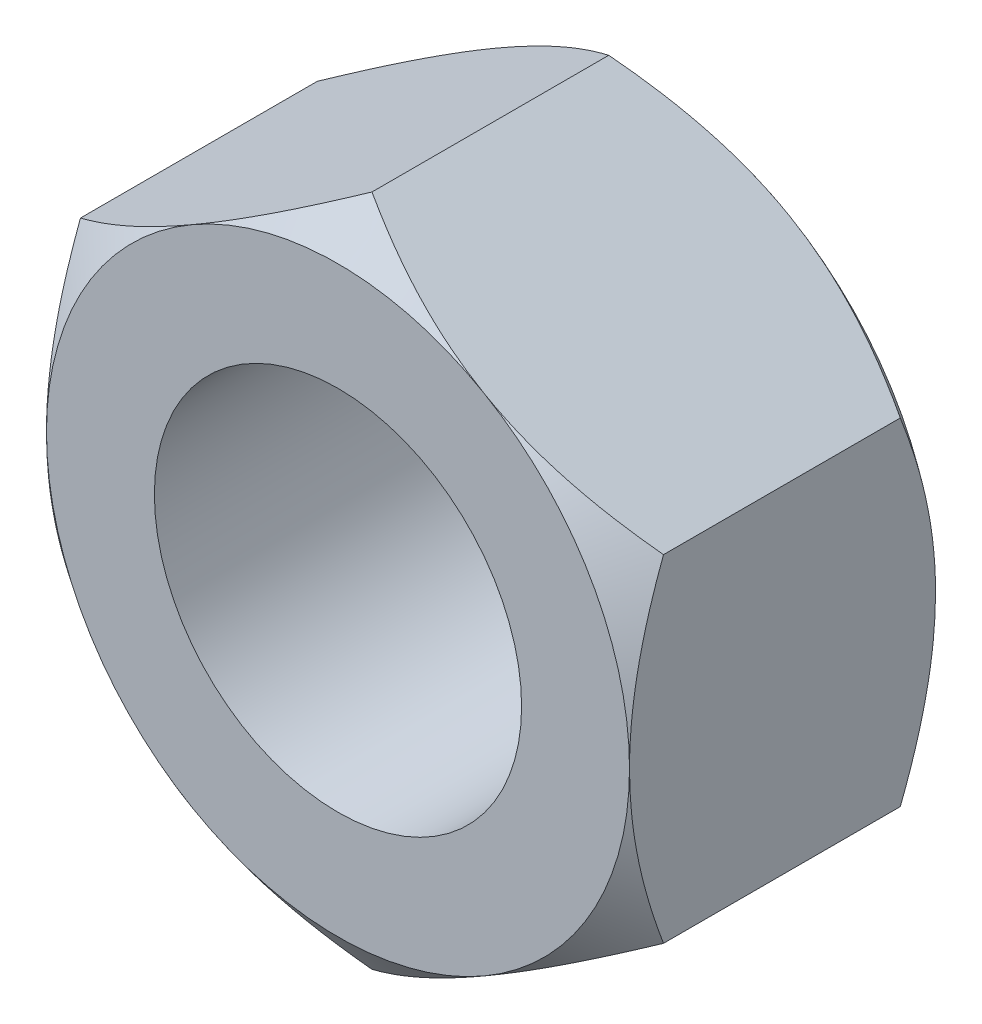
ISO-10303-21;
HEADER;
FILE_DESCRIPTION(('STEP AP214'),'2;1');
FILE_NAME('part.step','',(''),(''),'','','');
FILE_SCHEMA(('AUTOMOTIVE_DESIGN { 1 0 10303 214 1 1 1 1 }'));
ENDSEC;
DATA;
#1=APPLICATION_CONTEXT('core data for automotive mechanical design processes');
#2=APPLICATION_PROTOCOL_DEFINITION('international standard','automotive_design',2000,#1);
#3=PRODUCT_CONTEXT('',#1,'mechanical');
#4=PRODUCT('Part','Part','',(#3));
#5=PRODUCT_RELATED_PRODUCT_CATEGORY('part','',(#4));
#6=PRODUCT_DEFINITION_FORMATION('','',#4);
#7=PRODUCT_DEFINITION_CONTEXT('part definition',#1,'design');
#8=PRODUCT_DEFINITION('design','',#6,#7);
#9=PRODUCT_DEFINITION_SHAPE('','',#8);
#10=(LENGTH_UNIT() NAMED_UNIT(*) SI_UNIT(.MILLI.,.METRE.));
#11=(NAMED_UNIT(*) PLANE_ANGLE_UNIT() SI_UNIT($,.RADIAN.));
#12=(NAMED_UNIT(*) SI_UNIT($,.STERADIAN.) SOLID_ANGLE_UNIT());
#13=UNCERTAINTY_MEASURE_WITH_UNIT(LENGTH_MEASURE(1.E-05),#10,'distance_accuracy_value','');
#14=(GEOMETRIC_REPRESENTATION_CONTEXT(3) GLOBAL_UNCERTAINTY_ASSIGNED_CONTEXT((#13)) GLOBAL_UNIT_ASSIGNED_CONTEXT((#10,
#11,#12)) REPRESENTATION_CONTEXT('',''));
#15=CARTESIAN_POINT('',(0.,0.,0.));
#16=DIRECTION('',(0.,0.,1.));
#17=DIRECTION('',(1.,0.,0.));
#18=AXIS2_PLACEMENT_3D('',#15,#16,#17);
#19=CARTESIAN_POINT('',(-4.76313972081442,2.75,-5.));
#20=DIRECTION('',(-1.,0.,0.));
#21=DIRECTION('',(0.,-1.,0.));
#22=AXIS2_PLACEMENT_3D('',#19,#20,#21);
#23=PLANE('',#22);
#24=DIRECTION('',(0.,0.,1.));
#25=VECTOR('',#24,1.);
#26=CARTESIAN_POINT('',(-4.76313972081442,2.75,-5.));
#27=LINE('',#26,#25);
#28=CARTESIAN_POINT('',(-4.76313972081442,2.75,-4.42430165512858));
#29=VERTEX_POINT('',#28);
#30=CARTESIAN_POINT('',(-4.76313972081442,2.75,-0.555264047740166));
#31=VERTEX_POINT('',#30);
#32=EDGE_CURVE('E257',#29,#31,#27,.T.);
#33=ORIENTED_EDGE('',*,*,#32,.F.);
#34=CARTESIAN_POINT('',(-4.7631397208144,-6.40995958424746,-2.48208008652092));
#35=CARTESIAN_POINT('',(-4.7631397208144,-6.24286028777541,-2.58684300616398));
#36=CARTESIAN_POINT('',(-4.7631397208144,-6.07511976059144,-2.69060000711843));
#37=CARTESIAN_POINT('',(-4.7631397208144,-5.73806517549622,-2.89560261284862));
#38=CARTESIAN_POINT('',(-4.7631397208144,-5.56875079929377,-2.99684769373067));
#39=CARTESIAN_POINT('',(-4.7631397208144,-5.22718056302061,-3.19695438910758));
#40=CARTESIAN_POINT('',(-4.7631397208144,-5.05491257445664,-3.29579537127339));
#41=CARTESIAN_POINT('',(-4.7631397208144,-4.70824421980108,-3.48965168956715));
#42=CARTESIAN_POINT('',(-4.7631397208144,-4.53384398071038,-3.58466725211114));
#43=CARTESIAN_POINT('',(-4.7631397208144,-4.17394695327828,-3.77448040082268));
#44=CARTESIAN_POINT('',(-4.7631397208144,-3.9883242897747,-3.86904057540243));
#45=CARTESIAN_POINT('',(-4.7631397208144,-3.61380613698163,-4.05155429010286));
#46=CARTESIAN_POINT('',(-4.7631397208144,-3.42491020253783,-4.13950692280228));
#47=CARTESIAN_POINT('',(-4.7631397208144,-3.04385740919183,-4.30674347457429));
#48=CARTESIAN_POINT('',(-4.7631397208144,-2.85171004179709,-4.38604882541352));
#49=CARTESIAN_POINT('',(-4.7631397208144,-2.4633488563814,-4.53388173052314));
#50=CARTESIAN_POINT('',(-4.7631397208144,-2.26713663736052,-4.60241343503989));
#51=CARTESIAN_POINT('',(-4.76313972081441,-1.86832727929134,-4.72653632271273));
#52=CARTESIAN_POINT('',(-4.76313972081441,-1.66568471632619,-4.78198398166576));
#53=CARTESIAN_POINT('',(-4.76313972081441,-1.25641216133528,-4.87574292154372));
#54=CARTESIAN_POINT('',(-4.76313972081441,-1.04978264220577,-4.91405622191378));
#55=CARTESIAN_POINT('',(-4.76313972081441,-0.637390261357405,-4.97011747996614));
#56=CARTESIAN_POINT('',(-4.76313972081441,-0.431676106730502,-4.98821538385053));
#57=CARTESIAN_POINT('',(-4.76313972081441,-0.019459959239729,-5.00344342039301));
#58=CARTESIAN_POINT('',(-4.76313972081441,0.187041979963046,-5.00057495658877));
#59=CARTESIAN_POINT('',(-4.76313972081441,0.582480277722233,-4.97519185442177));
#60=CARTESIAN_POINT('',(-4.76313972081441,0.771521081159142,-4.95423973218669));
#61=CARTESIAN_POINT('',(-4.76313972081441,1.14709578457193,-4.89631076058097));
#62=CARTESIAN_POINT('',(-4.76313972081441,1.33362949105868,-4.85933268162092));
#63=CARTESIAN_POINT('',(-4.76313972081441,1.70702035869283,-4.77073057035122));
#64=CARTESIAN_POINT('',(-4.76313972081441,1.89381165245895,-4.71883264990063));
#65=CARTESIAN_POINT('',(-4.76313972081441,2.17116202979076,-4.6321604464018));
#66=CARTESIAN_POINT('',(-4.76313972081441,2.26313790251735,-4.60179939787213));
#67=CARTESIAN_POINT('',(-4.76313972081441,2.44617130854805,-4.53842694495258));
#68=CARTESIAN_POINT('',(-4.76313972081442,2.53722886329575,-4.50541560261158));
#69=CARTESIAN_POINT('',(-4.76313972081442,2.79225842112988,-4.40916695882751));
#70=CARTESIAN_POINT('',(-4.76313972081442,2.9552064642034,-4.34321200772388));
#71=CARTESIAN_POINT('',(-4.76313972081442,3.27840071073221,-4.20495204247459));
#72=CARTESIAN_POINT('',(-4.76313972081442,3.43864631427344,-4.13264563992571));
#73=CARTESIAN_POINT('',(-4.76313972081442,3.7568341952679,-3.98281412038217));
#74=CARTESIAN_POINT('',(-4.76313972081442,3.91477440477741,-3.90528463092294));
#75=CARTESIAN_POINT('',(-4.76313972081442,4.2284966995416,-3.74602002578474));
#76=CARTESIAN_POINT('',(-4.76313972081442,4.38427893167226,-3.6642851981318));
#77=CARTESIAN_POINT('',(-4.76313972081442,4.69467491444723,-3.49698449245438));
#78=CARTESIAN_POINT('',(-4.76313972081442,4.84928021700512,-3.41140298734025));
#79=CARTESIAN_POINT('',(-4.76313972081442,5.15686083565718,-3.23735439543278));
#80=CARTESIAN_POINT('',(-4.76313972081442,5.30983608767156,-3.14888719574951));
#81=CARTESIAN_POINT('',(-4.76313972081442,5.76650948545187,-2.87999272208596));
#82=CARTESIAN_POINT('',(-4.76313972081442,6.06810328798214,-2.69599155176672));
#83=CARTESIAN_POINT('',(-4.76313972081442,6.63875962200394,-2.33896262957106));
#84=CARTESIAN_POINT('',(-4.76313972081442,6.90820406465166,-2.16654007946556));
#85=CARTESIAN_POINT('',(-4.76313972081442,7.44440299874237,-1.81750104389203));
#86=CARTESIAN_POINT('',(-4.76313972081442,7.71115717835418,-1.64088408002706));
#87=CARTESIAN_POINT('',(-4.76313972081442,8.23987356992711,-1.28622636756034));
#88=CARTESIAN_POINT('',(-4.76313972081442,8.50185705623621,-1.10821723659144));
#89=CARTESIAN_POINT('',(-4.76313972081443,9.02405717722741,-0.749736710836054));
#90=CARTESIAN_POINT('',(-4.76313972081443,9.28427415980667,-0.569265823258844));
#91=CARTESIAN_POINT('',(-4.76313972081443,9.54383141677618,-0.387862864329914));
#92=B_SPLINE_CURVE_WITH_KNOTS('',3,(#34,#35,#36,#37,#38,#39,#40,#41,#42,#43,#44,#45,#46,#47,#48,
#49,#50,#51,#52,#53,#54,#55,#56,#57,#58,#59,#60,#61,#62,#63,#64,#65,#66,#67,#68,#69,#70,#71,#72,
#73,#74,#75,#76,#77,#78,#79,#80,#81,#82,#83,#84,#85,#86,#87,#88,#89,#90,#91),.UNSPECIFIED.,.F.,
.F.,(4,2,2,2,2,2,2,2,2,2,2,2,2,2,2,2,2,2,2,2,2,2,2,2,2,2,2,2,4),(0.,0.591682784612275,
1.18348795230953,1.77927690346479,2.37503053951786,2.99988835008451,3.62483181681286,
4.24818939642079,4.87130625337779,5.50096987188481,6.13055925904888,6.74907232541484,
7.36754398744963,7.93738514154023,8.50727002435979,9.08836926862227,9.37890931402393,
9.66944255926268,10.1966315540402,10.7239360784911,11.2516876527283,11.7794031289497,
12.3095005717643,12.8396187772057,13.8993492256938,14.8589790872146,15.8187189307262,
16.7689160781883,17.7189203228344),.UNSPECIFIED.);
#93=CARTESIAN_POINT('',(-4.76313972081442,0.,-5.));
#94=VERTEX_POINT('',#93);
#95=EDGE_CURVE('E148',#29,#94,#92,.F.);
#96=ORIENTED_EDGE('',*,*,#95,.T.);
#97=CARTESIAN_POINT('',(-4.7631397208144,-2.75000000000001,-4.42430165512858));
#98=VERTEX_POINT('',#97);
#99=EDGE_CURVE('E157',#94,#98,#92,.F.);
#100=ORIENTED_EDGE('',*,*,#99,.T.);
#101=DIRECTION('',(0.,0.,1.));
#102=VECTOR('',#101,1.);
#103=CARTESIAN_POINT('',(-4.7631397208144,-2.75000000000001,-5.));
#104=LINE('',#103,#102);
#105=CARTESIAN_POINT('',(-4.7631397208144,-2.75000000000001,-0.555264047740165));
#106=VERTEX_POINT('',#105);
#107=EDGE_CURVE('E264',#98,#106,#104,.T.);
#108=ORIENTED_EDGE('',*,*,#107,.T.);
#109=CARTESIAN_POINT('',(-4.7631397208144,-6.52667787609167,-2.49936933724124));
#110=CARTESIAN_POINT('',(-4.7631397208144,-6.35458657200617,-2.39464437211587));
#111=CARTESIAN_POINT('',(-4.7631397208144,-6.18187076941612,-2.29092857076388));
#112=CARTESIAN_POINT('',(-4.7631397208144,-5.83490079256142,-2.08602472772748));
#113=CARTESIAN_POINT('',(-4.7631397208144,-5.66064631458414,-1.98483720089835));
#114=CARTESIAN_POINT('',(-4.7631397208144,-5.30922187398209,-1.78488373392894));
#115=CARTESIAN_POINT('',(-4.7631397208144,-5.132040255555,-1.68613820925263));
#116=CARTESIAN_POINT('',(-4.7631397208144,-4.77558445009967,-1.49251204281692));
#117=CARTESIAN_POINT('',(-4.7631397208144,-4.59631038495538,-1.39763117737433));
#118=CARTESIAN_POINT('',(-4.7631397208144,-4.22688221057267,-1.20836695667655));
#119=CARTESIAN_POINT('',(-4.7631397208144,-4.03661020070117,-1.11421251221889));
#120=CARTESIAN_POINT('',(-4.7631397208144,-3.652854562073,-0.932577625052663));
#121=CARTESIAN_POINT('',(-4.7631397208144,-3.45937050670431,-0.845098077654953));
#122=CARTESIAN_POINT('',(-4.7631397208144,-3.06920692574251,-0.678900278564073));
#123=CARTESIAN_POINT('',(-4.7631397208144,-2.87253648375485,-0.600160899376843));
#124=CARTESIAN_POINT('',(-4.7631397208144,-2.47520474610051,-0.453599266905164));
#125=CARTESIAN_POINT('',(-4.7631397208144,-2.27454498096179,-0.385772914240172));
#126=CARTESIAN_POINT('',(-4.76313972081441,-1.8640140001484,-0.262386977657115));
#127=CARTESIAN_POINT('',(-4.76313972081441,-1.65403764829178,-0.207170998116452));
#128=CARTESIAN_POINT('',(-4.76313972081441,-1.23012378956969,-0.1146198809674));
#129=CARTESIAN_POINT('',(-4.76313972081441,-1.01618688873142,-0.0772820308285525));
#130=CARTESIAN_POINT('',(-4.76313972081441,-0.589334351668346,-0.023954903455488));
#131=CARTESIAN_POINT('',(-4.76313972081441,-0.376464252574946,-0.00761007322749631));
#132=CARTESIAN_POINT('',(-4.76313972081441,0.0498511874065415,0.0033921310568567));
#133=CARTESIAN_POINT('',(-4.76313972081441,0.26329651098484,-0.00194984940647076));
#134=CARTESIAN_POINT('',(-4.76313972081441,0.671122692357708,-0.0324900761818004));
#135=CARTESIAN_POINT('',(-4.76313972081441,0.865633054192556,-0.0560260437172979));
#136=CARTESIAN_POINT('',(-4.76313972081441,1.2519812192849,-0.119195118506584));
#137=CARTESIAN_POINT('',(-4.76313972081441,1.44381885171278,-0.158829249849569));
#138=CARTESIAN_POINT('',(-4.76313972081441,1.82782928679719,-0.252718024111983));
#139=CARTESIAN_POINT('',(-4.76313972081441,2.01993473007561,-0.3072444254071));
#140=CARTESIAN_POINT('',(-4.76313972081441,2.30525521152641,-0.397741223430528));
#141=CARTESIAN_POINT('',(-4.76313972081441,2.39988760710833,-0.429357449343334));
#142=CARTESIAN_POINT('',(-4.76313972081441,2.58823901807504,-0.495196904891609));
#143=CARTESIAN_POINT('',(-4.76313972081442,2.68195806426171,-0.529420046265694));
#144=CARTESIAN_POINT('',(-4.76313972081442,2.95885962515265,-0.634462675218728));
#145=CARTESIAN_POINT('',(-4.76313972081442,3.14077712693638,-0.708623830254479));
#146=CARTESIAN_POINT('',(-4.76313972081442,3.5015403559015,-0.864112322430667));
#147=CARTESIAN_POINT('',(-4.76313972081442,3.68038532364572,-0.945441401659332));
#148=CARTESIAN_POINT('',(-4.76313972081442,4.03552247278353,-1.11387738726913));
#149=CARTESIAN_POINT('',(-4.76313972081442,4.21181215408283,-1.20098954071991));
#150=CARTESIAN_POINT('',(-4.76313972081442,4.56203233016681,-1.37977912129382));
#151=CARTESIAN_POINT('',(-4.76313972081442,4.73596300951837,-1.47145618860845));
#152=CARTESIAN_POINT('',(-4.76313972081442,5.0826144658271,-1.6589290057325));
#153=CARTESIAN_POINT('',(-4.76313972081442,5.2553260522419,-1.75474169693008));
#154=CARTESIAN_POINT('',(-4.76313972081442,5.59903046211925,-1.94940702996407));
#155=CARTESIAN_POINT('',(-4.76313972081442,5.77002322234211,-2.0482597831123));
#156=CARTESIAN_POINT('',(-4.76313972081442,6.28063794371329,-2.3484332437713));
#157=CARTESIAN_POINT('',(-4.76313972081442,6.6180759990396,-2.5534678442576));
#158=CARTESIAN_POINT('',(-4.76313972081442,7.25445162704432,-2.94910954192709));
#159=CARTESIAN_POINT('',(-4.76313972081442,7.55380453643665,-3.13905415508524));
#160=CARTESIAN_POINT('',(-4.76313972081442,8.14988607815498,-3.52309555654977));
#161=CARTESIAN_POINT('',(-4.76313972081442,8.44661437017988,-3.71719287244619));
#162=CARTESIAN_POINT('',(-4.76313972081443,9.03509530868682,-4.10659479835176));
#163=CARTESIAN_POINT('',(-4.76313972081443,9.32686821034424,-4.30186888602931));
#164=CARTESIAN_POINT('',(-4.76313972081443,9.90871786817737,-4.69480502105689));
#165=CARTESIAN_POINT('',(-4.76313972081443,10.1987949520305,-4.89246658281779));
#166=CARTESIAN_POINT('',(-4.76313972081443,10.4882515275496,-5.09102228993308));
#167=B_SPLINE_CURVE_WITH_KNOTS('',3,(#109,#110,#111,#112,#113,#114,#115,#116,#117,#118,#119,
#120,#121,#122,#123,#124,#125,#126,#127,#128,#129,#130,#131,#132,#133,#134,#135,#136,#137,#138,
#139,#140,#141,#142,#143,#144,#145,#146,#147,#148,#149,#150,#151,#152,#153,#154,#155,#156,#157,
#158,#159,#160,#161,#162,#163,#164,#165,#166),.UNSPECIFIED.,.F.,.F.,(4,2,2,2,2,2,2,2,2,2,2,2,2,
2,2,2,2,2,2,2,2,2,2,2,2,2,2,2,4),(0.,0.604364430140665,1.20885094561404,1.81733113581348,
2.4257760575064,3.06255413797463,3.69941748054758,4.33470618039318,4.96975567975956,
5.62045978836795,6.27106513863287,6.91049941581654,7.54991466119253,8.13695505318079,
8.72403279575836,9.3226362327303,9.62192841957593,9.92121047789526,10.5103558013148,
11.0996447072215,11.6894757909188,12.2792604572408,12.8717464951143,13.4642542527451,
14.6486551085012,15.7122077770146,16.7758963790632,17.8291502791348,18.882193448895),.UNSPECIFIED.);
#168=CARTESIAN_POINT('',(-4.76313972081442,0.,0.));
#169=VERTEX_POINT('',#168);
#170=EDGE_CURVE('E310',#106,#169,#167,.T.);
#171=ORIENTED_EDGE('',*,*,#170,.T.);
#172=EDGE_CURVE('E307',#169,#31,#167,.T.);
#173=ORIENTED_EDGE('',*,*,#172,.T.);
#174=EDGE_LOOP('',(#33,#96,#100,#108,#171,#173));
#175=FACE_BOUND('',#174,.T.);
#176=ADVANCED_FACE('F28',(#175),#23,.T.);
#177=CARTESIAN_POINT('',(0.,5.50000000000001,-5.));
#178=DIRECTION('',(-0.500000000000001,0.866025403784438,0.));
#179=DIRECTION('',(-0.866025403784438,-0.500000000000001,0.));
#180=AXIS2_PLACEMENT_3D('',#177,#178,#179);
#181=PLANE('',#180);
#182=DIRECTION('',(0.,0.,1.));
#183=VECTOR('',#182,1.);
#184=CARTESIAN_POINT('',(0.,5.50000000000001,-5.));
#185=LINE('',#184,#183);
#186=CARTESIAN_POINT('',(0.,5.50000000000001,-4.42430165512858));
#187=VERTEX_POINT('',#186);
#188=CARTESIAN_POINT('',(0.,5.50000000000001,-0.555264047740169));
#189=VERTEX_POINT('',#188);
#190=EDGE_CURVE('E255',#187,#189,#185,.T.);
#191=ORIENTED_EDGE('',*,*,#190,.F.);
#192=CARTESIAN_POINT('',(0.000199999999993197,5.50011547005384,-4.42421143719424));
#193=CARTESIAN_POINT('',(-0.169583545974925,5.40209089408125,-4.50076965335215));
#194=CARTESIAN_POINT('',(-0.341323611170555,5.30293672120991,-4.57213656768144));
#195=CARTESIAN_POINT('',(-0.689104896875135,5.10214510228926,-4.70150205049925));
#196=CARTESIAN_POINT('',(-0.865157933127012,5.00050083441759,-4.75945792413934));
#197=CARTESIAN_POINT('',(-1.21919836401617,4.79609549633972,-4.85802484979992));
#198=CARTESIAN_POINT('',(-1.39715159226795,4.69335415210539,-4.89879514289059));
#199=CARTESIAN_POINT('',(-1.75543237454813,4.48650064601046,-4.9607079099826));
#200=CARTESIAN_POINT('',(-1.93575670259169,4.38239034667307,-4.98187471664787));
#201=CARTESIAN_POINT('',(-2.3000854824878,4.17204502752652,-5.00293890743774));
#202=CARTESIAN_POINT('',(-2.48410449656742,4.06580160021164,-5.00251164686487));
#203=CARTESIAN_POINT('',(-2.85117873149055,3.85387119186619,-4.97961179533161));
#204=CARTESIAN_POINT('',(-3.03423338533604,3.74818453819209,-4.9571274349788));
#205=CARTESIAN_POINT('',(-3.39757970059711,3.53840644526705,-4.89215538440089));
#206=CARTESIAN_POINT('',(-3.57787145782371,3.4343149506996,-4.84966838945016));
#207=CARTESIAN_POINT('',(-3.93475619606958,3.22826745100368,-4.74788059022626));
#208=CARTESIAN_POINT('',(-4.11134994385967,3.12631100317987,-4.68858330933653));
#209=CARTESIAN_POINT('',(-4.3664538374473,2.97902670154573,-4.59211737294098));
#210=CARTESIAN_POINT('',(-4.44651372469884,2.93280410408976,-4.56025443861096));
#211=CARTESIAN_POINT('',(-4.60562184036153,2.84094299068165,-4.49404002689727));
#212=CARTESIAN_POINT('',(-4.68467217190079,2.79530326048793,-4.459695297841));
#213=CARTESIAN_POINT('',(-4.76333972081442,2.74988452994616,-4.42421143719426));
#214=B_SPLINE_CURVE_WITH_KNOTS('',3,(#192,#193,#194,#195,#196,#197,#198,#199,#200,#201,#202,
#203,#204,#205,#206,#207,#208,#209,#210,#211,#212,#213),.UNSPECIFIED.,.F.,.F.,(4,2,2,2,2,2,2,2,
2,2,4),(0.,0.631654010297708,1.26529208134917,1.89292245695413,2.51977274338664,
3.15604984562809,3.79266664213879,4.42926131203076,5.06572265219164,5.35904081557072,
5.65158942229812),.UNSPECIFIED.);
#215=CARTESIAN_POINT('',(-2.38156986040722,4.125,-5.));
#216=VERTEX_POINT('',#215);
#217=EDGE_CURVE('E127',#187,#216,#214,.T.);
#218=ORIENTED_EDGE('',*,*,#217,.T.);
#219=EDGE_CURVE('E51',#216,#29,#214,.T.);
#220=ORIENTED_EDGE('',*,*,#219,.T.);
#221=ORIENTED_EDGE('',*,*,#32,.T.);
#222=CARTESIAN_POINT('',(-4.76333972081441,2.74988452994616,-0.55535106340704));
#223=CARTESIAN_POINT('',(-4.58839620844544,2.85088821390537,-0.479261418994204));
#224=CARTESIAN_POINT('',(-4.41149117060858,2.95302438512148,-0.408548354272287));
#225=CARTESIAN_POINT('',(-4.05340869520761,3.15976339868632,-0.280967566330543));
#226=CARTESIAN_POINT('',(-3.8722197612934,3.26437287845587,-0.224143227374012));
#227=CARTESIAN_POINT('',(-3.50806497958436,3.47461773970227,-0.128405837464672));
#228=CARTESIAN_POINT('',(-3.32513307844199,3.58023352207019,-0.0893254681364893));
#229=CARTESIAN_POINT('',(-2.95706281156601,3.79273898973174,-0.0313481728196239));
#230=CARTESIAN_POINT('',(-2.77192749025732,3.89962691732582,-0.0124260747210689));
#231=CARTESIAN_POINT('',(-2.39832843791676,4.11532443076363,0.00369118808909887));
#232=CARTESIAN_POINT('',(-2.20985438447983,4.2241399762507,0.00057860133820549));
#233=CARTESIAN_POINT('',(-1.83408971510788,4.44108780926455,-0.0278038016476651));
#234=CARTESIAN_POINT('',(-1.64679984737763,4.5492196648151,-0.0530864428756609));
#235=CARTESIAN_POINT('',(-1.27516310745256,4.76378423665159,-0.12350980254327));
#236=CARTESIAN_POINT('',(-1.09081558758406,4.87021732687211,-0.168646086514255));
#237=CARTESIAN_POINT('',(-0.725856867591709,5.0809263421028,-0.275446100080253));
#238=CARTESIAN_POINT('',(-0.545244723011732,5.18520281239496,-0.337105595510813));
#239=CARTESIAN_POINT('',(-0.304935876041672,5.32394518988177,-0.428883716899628));
#240=CARTESIAN_POINT('',(-0.243525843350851,5.35940028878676,-0.45320850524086));
#241=CARTESIAN_POINT('',(-0.121273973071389,5.42998243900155,-0.503254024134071));
#242=CARTESIAN_POINT('',(-0.0604312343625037,5.46511001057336,-0.528971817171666));
#243=CARTESIAN_POINT('',(0.000199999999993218,5.50011547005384,-0.555351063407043));
#244=B_SPLINE_CURVE_WITH_KNOTS('',3,(#222,#223,#224,#225,#226,#227,#228,#229,#230,#231,#232,
#233,#234,#235,#236,#237,#238,#239,#240,#241,#242,#243),.UNSPECIFIED.,.F.,.F.,(4,2,2,2,2,2,2,2,
2,2,4),(0.,0.647850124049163,1.2976987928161,1.94128546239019,2.58406752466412,3.23584465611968,
3.88799907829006,4.54000791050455,5.19184982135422,5.41674001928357,5.6411731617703),.UNSPECIFIED.);
#245=CARTESIAN_POINT('',(-2.38156986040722,4.125,0.));
#246=VERTEX_POINT('',#245);
#247=EDGE_CURVE('E302',#31,#246,#244,.T.);
#248=ORIENTED_EDGE('',*,*,#247,.T.);
#249=EDGE_CURVE('E228',#246,#189,#244,.T.);
#250=ORIENTED_EDGE('',*,*,#249,.T.);
#251=EDGE_LOOP('',(#191,#218,#220,#221,#248,#250));
#252=FACE_BOUND('',#251,.T.);
#253=ADVANCED_FACE('F236',(#252),#181,.T.);
#254=CARTESIAN_POINT('',(4.76313972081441,2.75000000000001,-5.));
#255=DIRECTION('',(0.499999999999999,0.866025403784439,0.));
#256=DIRECTION('',(-0.866025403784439,0.499999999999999,0.));
#257=AXIS2_PLACEMENT_3D('',#254,#255,#256);
#258=PLANE('',#257);
#259=DIRECTION('',(0.,0.,1.));
#260=VECTOR('',#259,1.);
#261=CARTESIAN_POINT('',(4.76313972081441,2.75000000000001,-5.));
#262=LINE('',#261,#260);
#263=CARTESIAN_POINT('',(4.76313972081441,2.75000000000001,-4.42430165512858));
#264=VERTEX_POINT('',#263);
#265=CARTESIAN_POINT('',(4.76313972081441,2.75000000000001,-0.555264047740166));
#266=VERTEX_POINT('',#265);
#267=EDGE_CURVE('E252',#264,#266,#262,.T.);
#268=ORIENTED_EDGE('',*,*,#267,.F.);
#269=CARTESIAN_POINT('',(4.76333972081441,2.74988452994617,-4.42421143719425));
#270=CARTESIAN_POINT('',(4.59355617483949,2.84790910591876,-4.50076965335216));
#271=CARTESIAN_POINT('',(4.42181610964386,2.9470632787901,-4.57213656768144));
#272=CARTESIAN_POINT('',(4.07403482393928,3.14785489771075,-4.70150205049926));
#273=CARTESIAN_POINT('',(3.8979817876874,3.24949916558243,-4.75945792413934));
#274=CARTESIAN_POINT('',(3.54394135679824,3.45390450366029,-4.85802484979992));
#275=CARTESIAN_POINT('',(3.36598812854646,3.55664584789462,-4.8987951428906));
#276=CARTESIAN_POINT('',(3.00770734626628,3.76349935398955,-4.96070790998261));
#277=CARTESIAN_POINT('',(2.82738301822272,3.86760965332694,-4.98187471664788));
#278=CARTESIAN_POINT('',(2.46305423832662,4.07795497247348,-5.00293890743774));
#279=CARTESIAN_POINT('',(2.27903522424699,4.18419839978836,-5.00251164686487));
#280=CARTESIAN_POINT('',(1.91196098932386,4.39612880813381,-4.97961179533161));
#281=CARTESIAN_POINT('',(1.72890633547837,4.50181546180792,-4.9571274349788));
#282=CARTESIAN_POINT('',(1.3655600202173,4.71159355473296,-4.89215538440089));
#283=CARTESIAN_POINT('',(1.1852682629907,4.8156850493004,-4.84966838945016));
#284=CARTESIAN_POINT('',(0.828383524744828,5.02173254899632,-4.74788059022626));
#285=CARTESIAN_POINT('',(0.651789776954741,5.12368899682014,-4.68858330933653));
#286=CARTESIAN_POINT('',(0.396685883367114,5.27097329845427,-4.59211737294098));
#287=CARTESIAN_POINT('',(0.316625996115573,5.31719589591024,-4.56025443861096));
#288=CARTESIAN_POINT('',(0.15751788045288,5.40905700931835,-4.49404002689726));
#289=CARTESIAN_POINT('',(0.0784675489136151,5.45469673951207,-4.459695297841));
#290=CARTESIAN_POINT('',(-0.000200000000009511,5.50011547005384,-4.42421143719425));
#291=B_SPLINE_CURVE_WITH_KNOTS('',3,(#269,#270,#271,#272,#273,#274,#275,#276,#277,#278,#279,
#280,#281,#282,#283,#284,#285,#286,#287,#288,#289,#290),.UNSPECIFIED.,.F.,.F.,(4,2,2,2,2,2,2,2,
2,2,4),(0.,0.631654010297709,1.26529208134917,1.89292245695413,2.51977274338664,
3.15604984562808,3.79266664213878,4.42926131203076,5.06572265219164,5.35904081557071,
5.65158942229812),.UNSPECIFIED.);
#292=CARTESIAN_POINT('',(2.38156986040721,4.12500000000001,-5.));
#293=VERTEX_POINT('',#292);
#294=EDGE_CURVE('E123',#264,#293,#291,.T.);
#295=ORIENTED_EDGE('',*,*,#294,.T.);
#296=EDGE_CURVE('E44',#293,#187,#291,.T.);
#297=ORIENTED_EDGE('',*,*,#296,.T.);
#298=ORIENTED_EDGE('',*,*,#190,.T.);
#299=CARTESIAN_POINT('',(-0.000200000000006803,5.50011547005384,-0.555351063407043));
#300=CARTESIAN_POINT('',(0.174743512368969,5.39911178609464,-0.479261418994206));
#301=CARTESIAN_POINT('',(0.351648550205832,5.29697561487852,-0.40854835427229));
#302=CARTESIAN_POINT('',(0.709731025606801,5.09023660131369,-0.280967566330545));
#303=CARTESIAN_POINT('',(0.890919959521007,4.98562712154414,-0.224143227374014));
#304=CARTESIAN_POINT('',(1.25507474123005,4.77538226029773,-0.128405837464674));
#305=CARTESIAN_POINT('',(1.43800664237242,4.66976647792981,-0.0893254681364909));
#306=CARTESIAN_POINT('',(1.8060769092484,4.45726101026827,-0.0313481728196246));
#307=CARTESIAN_POINT('',(1.99121223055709,4.35037308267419,-0.0124260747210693));
#308=CARTESIAN_POINT('',(2.36481128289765,4.13467556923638,0.00369118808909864));
#309=CARTESIAN_POINT('',(2.55328533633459,4.02586002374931,0.00057860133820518));
#310=CARTESIAN_POINT('',(2.92905000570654,3.80891219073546,-0.0278038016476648));
#311=CARTESIAN_POINT('',(3.11633987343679,3.70078033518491,-0.0530864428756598));
#312=CARTESIAN_POINT('',(3.48797661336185,3.48621576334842,-0.123509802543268));
#313=CARTESIAN_POINT('',(3.67232413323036,3.3797826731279,-0.168646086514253));
#314=CARTESIAN_POINT('',(4.03728285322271,3.16907365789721,-0.275446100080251));
#315=CARTESIAN_POINT('',(4.21789499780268,3.06479718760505,-0.337105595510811));
#316=CARTESIAN_POINT('',(4.45820384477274,2.92605481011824,-0.428883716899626));
#317=CARTESIAN_POINT('',(4.51961387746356,2.89059971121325,-0.453208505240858));
#318=CARTESIAN_POINT('',(4.64186574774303,2.82001756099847,-0.503254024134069));
#319=CARTESIAN_POINT('',(4.70270848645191,2.78488998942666,-0.528971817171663));
#320=CARTESIAN_POINT('',(4.76333972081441,2.74988452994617,-0.555351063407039));
#321=B_SPLINE_CURVE_WITH_KNOTS('',3,(#299,#300,#301,#302,#303,#304,#305,#306,#307,#308,#309,
#310,#311,#312,#313,#314,#315,#316,#317,#318,#319,#320),.UNSPECIFIED.,.F.,.F.,(4,2,2,2,2,2,2,2,
2,2,4),(0.,0.647850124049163,1.2976987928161,1.94128546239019,2.58406752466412,3.23584465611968,
3.88799907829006,4.54000791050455,5.19184982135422,5.41674001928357,5.6411731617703),.UNSPECIFIED.);
#322=CARTESIAN_POINT('',(2.38156986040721,4.12500000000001,0.));
#323=VERTEX_POINT('',#322);
#324=EDGE_CURVE('E227',#189,#323,#321,.T.);
#325=ORIENTED_EDGE('',*,*,#324,.T.);
#326=EDGE_CURVE('E221',#323,#266,#321,.T.);
#327=ORIENTED_EDGE('',*,*,#326,.T.);
#328=EDGE_LOOP('',(#268,#295,#297,#298,#325,#327));
#329=FACE_BOUND('',#328,.T.);
#330=ADVANCED_FACE('F233',(#329),#258,.T.);
#331=CARTESIAN_POINT('',(4.76313972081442,-2.74999999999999,-5.));
#332=DIRECTION('',(1.,0.,0.));
#333=DIRECTION('',(0.,1.,0.));
#334=AXIS2_PLACEMENT_3D('',#331,#332,#333);
#335=PLANE('',#334);
#336=DIRECTION('',(0.,0.,1.));
#337=VECTOR('',#336,1.);
#338=CARTESIAN_POINT('',(4.76313972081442,-2.74999999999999,-5.));
#339=LINE('',#338,#337);
#340=CARTESIAN_POINT('',(4.76313972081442,-2.74999999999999,-4.42430165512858));
#341=VERTEX_POINT('',#340);
#342=CARTESIAN_POINT('',(4.76313972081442,-2.74999999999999,-0.555264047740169));
#343=VERTEX_POINT('',#342);
#344=EDGE_CURVE('E146',#341,#343,#339,.T.);
#345=ORIENTED_EDGE('',*,*,#344,.F.);
#346=CARTESIAN_POINT('',(4.76313972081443,-6.40995958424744,-2.48208008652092));
#347=CARTESIAN_POINT('',(4.76313972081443,-6.24286028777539,-2.58684300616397));
#348=CARTESIAN_POINT('',(4.76313972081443,-6.07511976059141,-2.69060000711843));
#349=CARTESIAN_POINT('',(4.76313972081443,-5.7380651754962,-2.89560261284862));
#350=CARTESIAN_POINT('',(4.76313972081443,-5.56875079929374,-2.99684769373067));
#351=CARTESIAN_POINT('',(4.76313972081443,-5.22718056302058,-3.19695438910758));
#352=CARTESIAN_POINT('',(4.76313972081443,-5.05491257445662,-3.29579537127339));
#353=CARTESIAN_POINT('',(4.76313972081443,-4.70824421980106,-3.48965168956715));
#354=CARTESIAN_POINT('',(4.76313972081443,-4.53384398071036,-3.58466725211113));
#355=CARTESIAN_POINT('',(4.76313972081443,-4.17394695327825,-3.77448040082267));
#356=CARTESIAN_POINT('',(4.76313972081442,-3.98832428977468,-3.86904057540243));
#357=CARTESIAN_POINT('',(4.76313972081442,-3.6138061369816,-4.05155429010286));
#358=CARTESIAN_POINT('',(4.76313972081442,-3.4249102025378,-4.13950692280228));
#359=CARTESIAN_POINT('',(4.76313972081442,-3.04385740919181,-4.30674347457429));
#360=CARTESIAN_POINT('',(4.76313972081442,-2.85171004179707,-4.38604882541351));
#361=CARTESIAN_POINT('',(4.76313972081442,-2.46334885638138,-4.53388173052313));
#362=CARTESIAN_POINT('',(4.76313972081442,-2.2671366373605,-4.60241343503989));
#363=CARTESIAN_POINT('',(4.76313972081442,-1.86832727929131,-4.72653632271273));
#364=CARTESIAN_POINT('',(4.76313972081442,-1.66568471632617,-4.78198398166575));
#365=CARTESIAN_POINT('',(4.76313972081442,-1.25641216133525,-4.87574292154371));
#366=CARTESIAN_POINT('',(4.76313972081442,-1.04978264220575,-4.91405622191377));
#367=CARTESIAN_POINT('',(4.76313972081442,-0.637390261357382,-4.97011747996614));
#368=CARTESIAN_POINT('',(4.76313972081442,-0.431676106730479,-4.98821538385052));
#369=CARTESIAN_POINT('',(4.76313972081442,-0.0194599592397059,-5.00344342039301));
#370=CARTESIAN_POINT('',(4.76313972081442,0.187041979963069,-5.00057495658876));
#371=CARTESIAN_POINT('',(4.76313972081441,0.582480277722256,-4.97519185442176));
#372=CARTESIAN_POINT('',(4.76313972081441,0.771521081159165,-4.95423973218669));
#373=CARTESIAN_POINT('',(4.76313972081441,1.14709578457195,-4.89631076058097));
#374=CARTESIAN_POINT('',(4.76313972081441,1.33362949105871,-4.85933268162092));
#375=CARTESIAN_POINT('',(4.76313972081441,1.70702035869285,-4.77073057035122));
#376=CARTESIAN_POINT('',(4.76313972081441,1.89381165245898,-4.71883264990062));
#377=CARTESIAN_POINT('',(4.76313972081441,2.17116202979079,-4.6321604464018));
#378=CARTESIAN_POINT('',(4.76313972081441,2.26313790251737,-4.60179939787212));
#379=CARTESIAN_POINT('',(4.76313972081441,2.44617130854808,-4.53842694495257));
#380=CARTESIAN_POINT('',(4.76313972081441,2.53722886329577,-4.50541560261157));
#381=CARTESIAN_POINT('',(4.76313972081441,2.7922584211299,-4.40916695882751));
#382=CARTESIAN_POINT('',(4.76313972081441,2.95520646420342,-4.34321200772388));
#383=CARTESIAN_POINT('',(4.76313972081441,3.27840071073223,-4.20495204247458));
#384=CARTESIAN_POINT('',(4.76313972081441,3.43864631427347,-4.13264563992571));
#385=CARTESIAN_POINT('',(4.76313972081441,3.75683419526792,-3.98281412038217));
#386=CARTESIAN_POINT('',(4.7631397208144,3.91477440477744,-3.90528463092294));
#387=CARTESIAN_POINT('',(4.7631397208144,4.22849669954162,-3.74602002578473));
#388=CARTESIAN_POINT('',(4.7631397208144,4.38427893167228,-3.66428519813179));
#389=CARTESIAN_POINT('',(4.7631397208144,4.69467491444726,-3.49698449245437));
#390=CARTESIAN_POINT('',(4.7631397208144,4.84928021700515,-3.41140298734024));
#391=CARTESIAN_POINT('',(4.7631397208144,5.1568608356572,-3.23735439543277));
#392=CARTESIAN_POINT('',(4.7631397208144,5.30983608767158,-3.14888719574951));
#393=CARTESIAN_POINT('',(4.7631397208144,5.7665094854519,-2.87999272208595));
#394=CARTESIAN_POINT('',(4.7631397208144,6.06810328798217,-2.69599155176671));
#395=CARTESIAN_POINT('',(4.7631397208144,6.63875962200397,-2.33896262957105));
#396=CARTESIAN_POINT('',(4.7631397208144,6.90820406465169,-2.16654007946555));
#397=CARTESIAN_POINT('',(4.7631397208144,7.4444029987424,-1.81750104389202));
#398=CARTESIAN_POINT('',(4.7631397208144,7.71115717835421,-1.64088408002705));
#399=CARTESIAN_POINT('',(4.76313972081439,8.23987356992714,-1.28622636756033));
#400=CARTESIAN_POINT('',(4.76313972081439,8.50185705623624,-1.10821723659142));
#401=CARTESIAN_POINT('',(4.76313972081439,9.02405717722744,-0.749736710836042));
#402=CARTESIAN_POINT('',(4.76313972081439,9.2842741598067,-0.56926582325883));
#403=CARTESIAN_POINT('',(4.76313972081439,9.54383141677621,-0.387862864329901));
#404=B_SPLINE_CURVE_WITH_KNOTS('',3,(#346,#347,#348,#349,#350,#351,#352,#353,#354,#355,#356,
#357,#358,#359,#360,#361,#362,#363,#364,#365,#366,#367,#368,#369,#370,#371,#372,#373,#374,#375,
#376,#377,#378,#379,#380,#381,#382,#383,#384,#385,#386,#387,#388,#389,#390,#391,#392,#393,#394,
#395,#396,#397,#398,#399,#400,#401,#402,#403),.UNSPECIFIED.,.F.,.F.,(4,2,2,2,2,2,2,2,2,2,2,2,2,
2,2,2,2,2,2,2,2,2,2,2,2,2,2,2,4),(0.,0.591682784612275,1.18348795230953,1.77927690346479,
2.37503053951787,2.99988835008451,3.62483181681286,4.24818939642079,4.87130625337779,
5.50096987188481,6.13055925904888,6.74907232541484,7.36754398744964,7.93738514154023,
8.50727002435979,9.08836926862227,9.37890931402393,9.66944255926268,10.1966315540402,
10.7239360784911,11.2516876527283,11.7794031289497,12.3095005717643,12.8396187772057,
13.8993492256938,14.8589790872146,15.8187189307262,16.7689160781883,17.7189203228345),.UNSPECIFIED.);
#405=CARTESIAN_POINT('',(4.76313972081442,0.,-5.));
#406=VERTEX_POINT('',#405);
#407=EDGE_CURVE('E129',#341,#406,#404,.T.);
#408=ORIENTED_EDGE('',*,*,#407,.T.);
#409=EDGE_CURVE('E117',#406,#264,#404,.T.);
#410=ORIENTED_EDGE('',*,*,#409,.T.);
#411=ORIENTED_EDGE('',*,*,#267,.T.);
#412=CARTESIAN_POINT('',(4.76313972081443,-6.52667787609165,-2.49936933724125));
#413=CARTESIAN_POINT('',(4.76313972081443,-6.35458657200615,-2.39464437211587));
#414=CARTESIAN_POINT('',(4.76313972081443,-6.1818707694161,-2.29092857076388));
#415=CARTESIAN_POINT('',(4.76313972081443,-5.83490079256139,-2.08602472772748));
#416=CARTESIAN_POINT('',(4.76313972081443,-5.66064631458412,-1.98483720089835));
#417=CARTESIAN_POINT('',(4.76313972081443,-5.30922187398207,-1.78488373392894));
#418=CARTESIAN_POINT('',(4.76313972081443,-5.13204025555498,-1.68613820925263));
#419=CARTESIAN_POINT('',(4.76313972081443,-4.77558445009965,-1.49251204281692));
#420=CARTESIAN_POINT('',(4.76313972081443,-4.59631038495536,-1.39763117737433));
#421=CARTESIAN_POINT('',(4.76313972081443,-4.22688221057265,-1.20836695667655));
#422=CARTESIAN_POINT('',(4.76313972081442,-4.03661020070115,-1.11421251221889));
#423=CARTESIAN_POINT('',(4.76313972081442,-3.65285456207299,-0.932577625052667));
#424=CARTESIAN_POINT('',(4.76313972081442,-3.45937050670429,-0.845098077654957));
#425=CARTESIAN_POINT('',(4.76313972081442,-3.06920692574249,-0.678900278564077));
#426=CARTESIAN_POINT('',(4.76313972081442,-2.87253648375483,-0.600160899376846));
#427=CARTESIAN_POINT('',(4.76313972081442,-2.47520474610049,-0.453599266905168));
#428=CARTESIAN_POINT('',(4.76313972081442,-2.27454498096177,-0.385772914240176));
#429=CARTESIAN_POINT('',(4.76313972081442,-1.86401400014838,-0.262386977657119));
#430=CARTESIAN_POINT('',(4.76313972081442,-1.65403764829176,-0.207170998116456));
#431=CARTESIAN_POINT('',(4.76313972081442,-1.23012378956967,-0.114619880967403));
#432=CARTESIAN_POINT('',(4.76313972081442,-1.0161868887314,-0.0772820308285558));
#433=CARTESIAN_POINT('',(4.76313972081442,-0.589334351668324,-0.0239549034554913));
#434=CARTESIAN_POINT('',(4.76313972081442,-0.376464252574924,-0.00761007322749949));
#435=CARTESIAN_POINT('',(4.76313972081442,0.0498511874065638,0.00339213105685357));
#436=CARTESIAN_POINT('',(4.76313972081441,0.263296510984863,-0.00194984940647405));
#437=CARTESIAN_POINT('',(4.76313972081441,0.671122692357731,-0.0324900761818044));
#438=CARTESIAN_POINT('',(4.76313972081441,0.865633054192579,-0.0560260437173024));
#439=CARTESIAN_POINT('',(4.76313972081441,1.25198121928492,-0.119195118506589));
#440=CARTESIAN_POINT('',(4.76313972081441,1.4438188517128,-0.158829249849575));
#441=CARTESIAN_POINT('',(4.76313972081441,1.82782928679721,-0.252718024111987));
#442=CARTESIAN_POINT('',(4.76313972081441,2.01993473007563,-0.307244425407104));
#443=CARTESIAN_POINT('',(4.76313972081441,2.30525521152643,-0.397741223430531));
#444=CARTESIAN_POINT('',(4.76313972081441,2.39988760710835,-0.429357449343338));
#445=CARTESIAN_POINT('',(4.76313972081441,2.58823901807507,-0.495196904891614));
#446=CARTESIAN_POINT('',(4.76313972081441,2.68195806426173,-0.529420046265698));
#447=CARTESIAN_POINT('',(4.76313972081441,2.95885962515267,-0.634462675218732));
#448=CARTESIAN_POINT('',(4.76313972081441,3.1407771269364,-0.708623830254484));
#449=CARTESIAN_POINT('',(4.76313972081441,3.50154035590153,-0.864112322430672));
#450=CARTESIAN_POINT('',(4.76313972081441,3.68038532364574,-0.945441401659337));
#451=CARTESIAN_POINT('',(4.7631397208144,4.03552247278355,-1.11387738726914));
#452=CARTESIAN_POINT('',(4.7631397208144,4.21181215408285,-1.20098954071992));
#453=CARTESIAN_POINT('',(4.7631397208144,4.56203233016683,-1.37977912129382));
#454=CARTESIAN_POINT('',(4.7631397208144,4.7359630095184,-1.47145618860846));
#455=CARTESIAN_POINT('',(4.7631397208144,5.08261446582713,-1.65892900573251));
#456=CARTESIAN_POINT('',(4.7631397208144,5.25532605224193,-1.75474169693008));
#457=CARTESIAN_POINT('',(4.7631397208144,5.59903046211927,-1.94940702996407));
#458=CARTESIAN_POINT('',(4.7631397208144,5.77002322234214,-2.04825978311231));
#459=CARTESIAN_POINT('',(4.7631397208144,6.28063794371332,-2.34843324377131));
#460=CARTESIAN_POINT('',(4.7631397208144,6.61807599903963,-2.55346784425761));
#461=CARTESIAN_POINT('',(4.7631397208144,7.25445162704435,-2.9491095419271));
#462=CARTESIAN_POINT('',(4.7631397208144,7.55380453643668,-3.13905415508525));
#463=CARTESIAN_POINT('',(4.76313972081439,8.14988607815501,-3.52309555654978));
#464=CARTESIAN_POINT('',(4.76313972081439,8.44661437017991,-3.71719287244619));
#465=CARTESIAN_POINT('',(4.76313972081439,9.03509530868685,-4.10659479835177));
#466=CARTESIAN_POINT('',(4.76313972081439,9.32686821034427,-4.30186888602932));
#467=CARTESIAN_POINT('',(4.76313972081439,9.9087178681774,-4.69480502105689));
#468=CARTESIAN_POINT('',(4.76313972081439,10.1987949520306,-4.8924665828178));
#469=CARTESIAN_POINT('',(4.76313972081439,10.4882515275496,-5.09102228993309));
#470=B_SPLINE_CURVE_WITH_KNOTS('',3,(#412,#413,#414,#415,#416,#417,#418,#419,#420,#421,#422,
#423,#424,#425,#426,#427,#428,#429,#430,#431,#432,#433,#434,#435,#436,#437,#438,#439,#440,#441,
#442,#443,#444,#445,#446,#447,#448,#449,#450,#451,#452,#453,#454,#455,#456,#457,#458,#459,#460,
#461,#462,#463,#464,#465,#466,#467,#468,#469),.UNSPECIFIED.,.F.,.F.,(4,2,2,2,2,2,2,2,2,2,2,2,2,
2,2,2,2,2,2,2,2,2,2,2,2,2,2,2,4),(0.,0.604364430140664,1.20885094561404,1.81733113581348,
2.4257760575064,3.06255413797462,3.69941748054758,4.33470618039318,4.96975567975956,
5.62045978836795,6.27106513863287,6.91049941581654,7.54991466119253,8.13695505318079,
8.72403279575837,9.3226362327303,9.62192841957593,9.92121047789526,10.5103558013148,
11.0996447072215,11.6894757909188,12.2792604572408,12.8717464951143,13.4642542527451,
14.6486551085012,15.7122077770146,16.7758963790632,17.8291502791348,18.882193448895),.UNSPECIFIED.);
#471=CARTESIAN_POINT('',(4.76313972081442,0.,0.));
#472=VERTEX_POINT('',#471);
#473=EDGE_CURVE('E220',#266,#472,#470,.F.);
#474=ORIENTED_EDGE('',*,*,#473,.T.);
#475=EDGE_CURVE('E215',#472,#343,#470,.F.);
#476=ORIENTED_EDGE('',*,*,#475,.T.);
#477=EDGE_LOOP('',(#345,#408,#410,#411,#474,#476));
#478=FACE_BOUND('',#477,.T.);
#479=ADVANCED_FACE('F144',(#478),#335,.T.);
#480=CARTESIAN_POINT('',(0.,-5.50000000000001,-5.));
#481=DIRECTION('',(0.500000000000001,-0.866025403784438,0.));
#482=DIRECTION('',(0.866025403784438,0.500000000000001,0.));
#483=AXIS2_PLACEMENT_3D('',#480,#481,#482);
#484=PLANE('',#483);
#485=DIRECTION('',(0.,0.,1.));
#486=VECTOR('',#485,1.);
#487=CARTESIAN_POINT('',(0.,-5.50000000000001,-5.));
#488=LINE('',#487,#486);
#489=CARTESIAN_POINT('',(0.,-5.50000000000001,-4.42430165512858));
#490=VERTEX_POINT('',#489);
#491=CARTESIAN_POINT('',(0.,-5.50000000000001,-0.555264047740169));
#492=VERTEX_POINT('',#491);
#493=EDGE_CURVE('E259',#490,#492,#488,.T.);
#494=ORIENTED_EDGE('',*,*,#493,.F.);
#495=CARTESIAN_POINT('',(-0.000200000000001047,-5.50011547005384,-4.42421143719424));
#496=CARTESIAN_POINT('',(0.169583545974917,-5.40209089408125,-4.50076965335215));
#497=CARTESIAN_POINT('',(0.341323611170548,-5.30293672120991,-4.57213656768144));
#498=CARTESIAN_POINT('',(0.689104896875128,-5.10214510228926,-4.70150205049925));
#499=CARTESIAN_POINT('',(0.865157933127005,-5.00050083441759,-4.75945792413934));
#500=CARTESIAN_POINT('',(1.21919836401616,-4.79609549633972,-4.85802484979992));
#501=CARTESIAN_POINT('',(1.39715159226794,-4.69335415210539,-4.8987951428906));
#502=CARTESIAN_POINT('',(1.75543237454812,-4.48650064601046,-4.96070790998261));
#503=CARTESIAN_POINT('',(1.93575670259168,-4.38239034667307,-4.98187471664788));
#504=CARTESIAN_POINT('',(2.30008548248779,-4.17204502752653,-5.00293890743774));
#505=CARTESIAN_POINT('',(2.48410449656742,-4.06580160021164,-5.00251164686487));
#506=CARTESIAN_POINT('',(2.85117873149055,-3.8538711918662,-4.97961179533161));
#507=CARTESIAN_POINT('',(3.03423338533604,-3.74818453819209,-4.9571274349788));
#508=CARTESIAN_POINT('',(3.39757970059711,-3.53840644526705,-4.89215538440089));
#509=CARTESIAN_POINT('',(3.57787145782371,-3.4343149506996,-4.84966838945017));
#510=CARTESIAN_POINT('',(3.93475619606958,-3.22826745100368,-4.74788059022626));
#511=CARTESIAN_POINT('',(4.11134994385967,-3.12631100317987,-4.68858330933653));
#512=CARTESIAN_POINT('',(4.3664538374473,-2.97902670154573,-4.59211737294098));
#513=CARTESIAN_POINT('',(4.44651372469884,-2.93280410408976,-4.56025443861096));
#514=CARTESIAN_POINT('',(4.60562184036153,-2.84094299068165,-4.49404002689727));
#515=CARTESIAN_POINT('',(4.6846721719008,-2.79530326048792,-4.459695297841));
#516=CARTESIAN_POINT('',(4.76333972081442,-2.74988452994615,-4.42421143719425));
#517=B_SPLINE_CURVE_WITH_KNOTS('',3,(#495,#496,#497,#498,#499,#500,#501,#502,#503,#504,#505,
#506,#507,#508,#509,#510,#511,#512,#513,#514,#515,#516),.UNSPECIFIED.,.F.,.F.,(4,2,2,2,2,2,2,2,
2,2,4),(0.,0.631654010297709,1.26529208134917,1.89292245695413,2.51977274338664,
3.15604984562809,3.79266664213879,4.42926131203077,5.06572265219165,5.35904081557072,
5.65158942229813),.UNSPECIFIED.);
#518=CARTESIAN_POINT('',(2.38156986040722,-4.125,-5.));
#519=VERTEX_POINT('',#518);
#520=EDGE_CURVE('E150',#490,#519,#517,.T.);
#521=ORIENTED_EDGE('',*,*,#520,.T.);
#522=EDGE_CURVE('E135',#519,#341,#517,.T.);
#523=ORIENTED_EDGE('',*,*,#522,.T.);
#524=ORIENTED_EDGE('',*,*,#344,.T.);
#525=CARTESIAN_POINT('',(4.76333972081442,-2.74988452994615,-0.555351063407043));
#526=CARTESIAN_POINT('',(4.58839620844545,-2.85088821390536,-0.479261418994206));
#527=CARTESIAN_POINT('',(4.41149117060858,-2.95302438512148,-0.408548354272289));
#528=CARTESIAN_POINT('',(4.05340869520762,-3.15976339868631,-0.280967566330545));
#529=CARTESIAN_POINT('',(3.87221976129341,-3.26437287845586,-0.224143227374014));
#530=CARTESIAN_POINT('',(3.50806497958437,-3.47461773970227,-0.128405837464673));
#531=CARTESIAN_POINT('',(3.325133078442,-3.58023352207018,-0.0893254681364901));
#532=CARTESIAN_POINT('',(2.95706281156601,-3.79273898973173,-0.0313481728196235));
#533=CARTESIAN_POINT('',(2.77192749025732,-3.89962691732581,-0.012426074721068));
#534=CARTESIAN_POINT('',(2.39832843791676,-4.11532443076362,0.00369118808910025));
#535=CARTESIAN_POINT('',(2.20985438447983,-4.22413997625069,0.000578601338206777));
#536=CARTESIAN_POINT('',(1.83408971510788,-4.44108780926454,-0.0278038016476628));
#537=CARTESIAN_POINT('',(1.64679984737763,-4.54921966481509,-0.0530864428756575));
#538=CARTESIAN_POINT('',(1.27516310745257,-4.76378423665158,-0.123509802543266));
#539=CARTESIAN_POINT('',(1.09081558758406,-4.87021732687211,-0.168646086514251));
#540=CARTESIAN_POINT('',(0.725856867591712,-5.08092634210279,-0.275446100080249));
#541=CARTESIAN_POINT('',(0.545244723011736,-5.18520281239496,-0.337105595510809));
#542=CARTESIAN_POINT('',(0.304935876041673,-5.32394518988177,-0.428883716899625));
#543=CARTESIAN_POINT('',(0.24352584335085,-5.35940028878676,-0.453208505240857));
#544=CARTESIAN_POINT('',(0.121273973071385,-5.42998243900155,-0.50325402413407));
#545=CARTESIAN_POINT('',(0.0604312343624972,-5.46511001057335,-0.528971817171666));
#546=CARTESIAN_POINT('',(-0.000200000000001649,-5.50011547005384,-0.555351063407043));
#547=B_SPLINE_CURVE_WITH_KNOTS('',3,(#525,#526,#527,#528,#529,#530,#531,#532,#533,#534,#535,
#536,#537,#538,#539,#540,#541,#542,#543,#544,#545,#546),.UNSPECIFIED.,.F.,.F.,(4,2,2,2,2,2,2,2,
2,2,4),(0.,0.647850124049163,1.2976987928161,1.94128546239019,2.58406752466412,3.23584465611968,
3.88799907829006,4.54000791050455,5.19184982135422,5.41674001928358,5.64117316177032),.UNSPECIFIED.);
#548=CARTESIAN_POINT('',(2.38156986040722,-4.12500000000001,0.));
#549=VERTEX_POINT('',#548);
#550=EDGE_CURVE('E208',#343,#549,#547,.T.);
#551=ORIENTED_EDGE('',*,*,#550,.T.);
#552=EDGE_CURVE('E201',#549,#492,#547,.T.);
#553=ORIENTED_EDGE('',*,*,#552,.T.);
#554=EDGE_LOOP('',(#494,#521,#523,#524,#551,#553));
#555=FACE_BOUND('',#554,.T.);
#556=ADVANCED_FACE('F193',(#555),#484,.T.);
#557=CARTESIAN_POINT('',(-4.7631397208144,-2.75000000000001,-5.));
#558=DIRECTION('',(-0.5,-0.866025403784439,0.));
#559=DIRECTION('',(0.866025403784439,-0.5,0.));
#560=AXIS2_PLACEMENT_3D('',#557,#558,#559);
#561=PLANE('',#560);
#562=ORIENTED_EDGE('',*,*,#107,.F.);
#563=CARTESIAN_POINT('',(-4.7633397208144,-2.74988452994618,-4.42421143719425));
#564=CARTESIAN_POINT('',(-4.59355617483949,-2.84790910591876,-4.50076965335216));
#565=CARTESIAN_POINT('',(-4.42181610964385,-2.9470632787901,-4.57213656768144));
#566=CARTESIAN_POINT('',(-4.07403482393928,-3.14785489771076,-4.70150205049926));
#567=CARTESIAN_POINT('',(-3.8979817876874,-3.24949916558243,-4.75945792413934));
#568=CARTESIAN_POINT('',(-3.54394135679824,-3.4539045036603,-4.85802484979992));
#569=CARTESIAN_POINT('',(-3.36598812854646,-3.55664584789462,-4.89879514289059));
#570=CARTESIAN_POINT('',(-3.00770734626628,-3.76349935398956,-4.9607079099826));
#571=CARTESIAN_POINT('',(-2.82738301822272,-3.86760965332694,-4.98187471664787));
#572=CARTESIAN_POINT('',(-2.46305423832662,-4.07795497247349,-5.00293890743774));
#573=CARTESIAN_POINT('',(-2.27903522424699,-4.18419839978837,-5.00251164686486));
#574=CARTESIAN_POINT('',(-1.91196098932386,-4.39612880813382,-4.97961179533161));
#575=CARTESIAN_POINT('',(-1.72890633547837,-4.50181546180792,-4.9571274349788));
#576=CARTESIAN_POINT('',(-1.3655600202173,-4.71159355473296,-4.89215538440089));
#577=CARTESIAN_POINT('',(-1.1852682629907,-4.81568504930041,-4.84966838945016));
#578=CARTESIAN_POINT('',(-0.828383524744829,-5.02173254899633,-4.74788059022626));
#579=CARTESIAN_POINT('',(-0.651789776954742,-5.12368899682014,-4.68858330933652));
#580=CARTESIAN_POINT('',(-0.396685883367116,-5.27097329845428,-4.59211737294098));
#581=CARTESIAN_POINT('',(-0.316625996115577,-5.31719589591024,-4.56025443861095));
#582=CARTESIAN_POINT('',(-0.157517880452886,-5.40905700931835,-4.49404002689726));
#583=CARTESIAN_POINT('',(-0.0784675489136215,-5.45469673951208,-4.459695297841));
#584=CARTESIAN_POINT('',(0.000200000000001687,-5.50011547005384,-4.42421143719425));
#585=B_SPLINE_CURVE_WITH_KNOTS('',3,(#563,#564,#565,#566,#567,#568,#569,#570,#571,#572,#573,
#574,#575,#576,#577,#578,#579,#580,#581,#582,#583,#584),.UNSPECIFIED.,.F.,.F.,(4,2,2,2,2,2,2,2,
2,2,4),(0.,0.631654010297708,1.26529208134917,1.89292245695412,2.51977274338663,
3.15604984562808,3.79266664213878,4.42926131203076,5.06572265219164,5.3590408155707,
5.65158942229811),.UNSPECIFIED.);
#586=CARTESIAN_POINT('',(-2.38156986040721,-4.12500000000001,-5.));
#587=VERTEX_POINT('',#586);
#588=EDGE_CURVE('E192',#98,#587,#585,.T.);
#589=ORIENTED_EDGE('',*,*,#588,.T.);
#590=EDGE_CURVE('E181',#587,#490,#585,.T.);
#591=ORIENTED_EDGE('',*,*,#590,.T.);
#592=ORIENTED_EDGE('',*,*,#493,.T.);
#593=CARTESIAN_POINT('',(0.000199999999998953,-5.50011547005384,-0.555351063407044));
#594=CARTESIAN_POINT('',(-0.174743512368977,-5.39911178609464,-0.479261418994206));
#595=CARTESIAN_POINT('',(-0.35164855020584,-5.29697561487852,-0.40854835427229));
#596=CARTESIAN_POINT('',(-0.709731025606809,-5.09023660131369,-0.280967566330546));
#597=CARTESIAN_POINT('',(-0.890919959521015,-4.98562712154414,-0.224143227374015));
#598=CARTESIAN_POINT('',(-1.25507474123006,-4.77538226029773,-0.128405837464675));
#599=CARTESIAN_POINT('',(-1.43800664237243,-4.66976647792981,-0.0893254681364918));
#600=CARTESIAN_POINT('',(-1.80607690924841,-4.45726101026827,-0.031348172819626));
#601=CARTESIAN_POINT('',(-1.9912122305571,-4.35037308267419,-0.0124260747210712));
#602=CARTESIAN_POINT('',(-2.36481128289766,-4.13467556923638,0.0036911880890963));
#603=CARTESIAN_POINT('',(-2.55328533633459,-4.0258600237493,0.000578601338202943));
#604=CARTESIAN_POINT('',(-2.92905000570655,-3.80891219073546,-0.0278038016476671));
#605=CARTESIAN_POINT('',(-3.1163398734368,-3.70078033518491,-0.0530864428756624));
#606=CARTESIAN_POINT('',(-3.48797661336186,-3.48621576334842,-0.123509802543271));
#607=CARTESIAN_POINT('',(-3.67232413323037,-3.3797826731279,-0.168646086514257));
#608=CARTESIAN_POINT('',(-4.03728285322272,-3.16907365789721,-0.275446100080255));
#609=CARTESIAN_POINT('',(-4.21789499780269,-3.06479718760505,-0.337105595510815));
#610=CARTESIAN_POINT('',(-4.45820384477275,-2.92605481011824,-0.42888371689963));
#611=CARTESIAN_POINT('',(-4.51961387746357,-2.89059971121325,-0.453208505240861));
#612=CARTESIAN_POINT('',(-4.64186574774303,-2.82001756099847,-0.50325402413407));
#613=CARTESIAN_POINT('',(-4.70270848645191,-2.78488998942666,-0.528971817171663));
#614=CARTESIAN_POINT('',(-4.7633397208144,-2.74988452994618,-0.555351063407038));
#615=B_SPLINE_CURVE_WITH_KNOTS('',3,(#593,#594,#595,#596,#597,#598,#599,#600,#601,#602,#603,
#604,#605,#606,#607,#608,#609,#610,#611,#612,#613,#614),.UNSPECIFIED.,.F.,.F.,(4,2,2,2,2,2,2,2,
2,2,4),(0.,0.647850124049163,1.2976987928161,1.94128546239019,2.58406752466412,3.23584465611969,
3.88799907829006,4.54000791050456,5.19184982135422,5.41674001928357,5.64117316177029),.UNSPECIFIED.);
#616=CARTESIAN_POINT('',(-2.38156986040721,-4.12500000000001,0.));
#617=VERTEX_POINT('',#616);
#618=EDGE_CURVE('E209',#492,#617,#615,.T.);
#619=ORIENTED_EDGE('',*,*,#618,.T.);
#620=EDGE_CURVE('E210',#617,#106,#615,.T.);
#621=ORIENTED_EDGE('',*,*,#620,.T.);
#622=EDGE_LOOP('',(#562,#589,#591,#592,#619,#621));
#623=FACE_BOUND('',#622,.T.);
#624=ADVANCED_FACE('F196',(#623),#561,.T.);
#625=CARTESIAN_POINT('',(-4.76313972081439,-8.25,-5.));
#626=DIRECTION('',(0.,0.,1.));
#627=DIRECTION('',(1.,0.,0.));
#628=AXIS2_PLACEMENT_3D('',#625,#626,#627);
#629=PLANE('',#628);
#630=CARTESIAN_POINT('',(0.,0.,-5.));
#631=DIRECTION('',(0.,0.,1.));
#632=DIRECTION('',(1.,0.,0.));
#633=AXIS2_PLACEMENT_3D('',#630,#631,#632);
#634=CIRCLE('',#633,3.);
#635=CARTESIAN_POINT('',(3.,0.,-5.));
#636=VERTEX_POINT('',#635);
#637=EDGE_CURVE('E265',#636,#636,#634,.T.);
#638=ORIENTED_EDGE('',*,*,#637,.T.);
#639=EDGE_LOOP('',(#638));
#640=FACE_BOUND('',#639,.T.);
#641=CARTESIAN_POINT('',(0.,0.,-5.));
#642=DIRECTION('',(0.,0.,1.));
#643=DIRECTION('',(1.,0.,0.));
#644=AXIS2_PLACEMENT_3D('',#641,#642,#643);
#645=CIRCLE('',#644,4.76313972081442);
#646=EDGE_CURVE('E11',#406,#293,#645,.T.);
#647=ORIENTED_EDGE('',*,*,#646,.F.);
#648=EDGE_CURVE('E32',#519,#406,#645,.T.);
#649=ORIENTED_EDGE('',*,*,#648,.F.);
#650=EDGE_CURVE('E139',#587,#519,#645,.T.);
#651=ORIENTED_EDGE('',*,*,#650,.F.);
#652=EDGE_CURVE('E340',#94,#587,#645,.T.);
#653=ORIENTED_EDGE('',*,*,#652,.F.);
#654=CARTESIAN_POINT('',(0.,0.,-5.));
#655=DIRECTION('',(0.,0.,-1.));
#656=DIRECTION('',(-1.,0.,0.));
#657=AXIS2_PLACEMENT_3D('',#654,#655,#656);
#658=CIRCLE('',#657,4.76313972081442);
#659=EDGE_CURVE('E342',#94,#216,#658,.T.);
#660=ORIENTED_EDGE('',*,*,#659,.T.);
#661=EDGE_CURVE('E37',#293,#216,#645,.T.);
#662=ORIENTED_EDGE('',*,*,#661,.F.);
#663=EDGE_LOOP('',(#647,#649,#651,#653,#660,#662));
#664=FACE_BOUND('',#663,.T.);
#665=ADVANCED_FACE('F141',(#640,#664),#629,.F.);
#666=CARTESIAN_POINT('',(-4.76313972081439,-8.25,0.));
#667=DIRECTION('',(0.,0.,1.));
#668=DIRECTION('',(1.,0.,0.));
#669=AXIS2_PLACEMENT_3D('',#666,#667,#668);
#670=PLANE('',#669);
#671=CARTESIAN_POINT('',(0.,0.,0.));
#672=DIRECTION('',(0.,0.,1.));
#673=DIRECTION('',(1.,0.,0.));
#674=AXIS2_PLACEMENT_3D('',#671,#672,#673);
#675=CIRCLE('',#674,3.);
#676=CARTESIAN_POINT('',(3.,0.,0.));
#677=VERTEX_POINT('',#676);
#678=EDGE_CURVE('E311',#677,#677,#675,.T.);
#679=ORIENTED_EDGE('',*,*,#678,.F.);
#680=EDGE_LOOP('',(#679));
#681=FACE_BOUND('',#680,.T.);
#682=CARTESIAN_POINT('',(0.,0.,0.));
#683=DIRECTION('',(0.,0.,1.));
#684=DIRECTION('',(1.,0.,0.));
#685=AXIS2_PLACEMENT_3D('',#682,#683,#684);
#686=CIRCLE('',#685,4.76313972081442);
#687=EDGE_CURVE('E266',#549,#472,#686,.T.);
#688=ORIENTED_EDGE('',*,*,#687,.T.);
#689=CARTESIAN_POINT('',(0.,0.,0.));
#690=DIRECTION('',(0.,0.,1.));
#691=DIRECTION('',(1.,0.,0.));
#692=AXIS2_PLACEMENT_3D('',#689,#690,#691);
#693=CIRCLE('',#692,4.76313972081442);
#694=EDGE_CURVE('E244',#472,#323,#693,.T.);
#695=ORIENTED_EDGE('',*,*,#694,.T.);
#696=EDGE_CURVE('E140',#323,#246,#686,.T.);
#697=ORIENTED_EDGE('',*,*,#696,.T.);
#698=EDGE_CURVE('E271',#246,#169,#686,.T.);
#699=ORIENTED_EDGE('',*,*,#698,.T.);
#700=EDGE_CURVE('E270',#169,#617,#686,.T.);
#701=ORIENTED_EDGE('',*,*,#700,.T.);
#702=EDGE_CURVE('E267',#617,#549,#686,.T.);
#703=ORIENTED_EDGE('',*,*,#702,.T.);
#704=EDGE_LOOP('',(#688,#695,#697,#699,#701,#703));
#705=FACE_BOUND('',#704,.T.);
#706=ADVANCED_FACE('F280',(#681,#705),#670,.T.);
#707=CARTESIAN_POINT('',(0.,0.,-5.));
#708=DIRECTION('',(0.,0.,1.));
#709=DIRECTION('',(1.,0.,0.));
#710=AXIS2_PLACEMENT_3D('',#707,#708,#709);
#711=CYLINDRICAL_SURFACE('',#710,3.);
#712=ORIENTED_EDGE('',*,*,#637,.F.);
#713=EDGE_LOOP('',(#712));
#714=FACE_BOUND('',#713,.T.);
#715=ORIENTED_EDGE('',*,*,#678,.T.);
#716=EDGE_LOOP('',(#715));
#717=FACE_BOUND('',#716,.T.);
#718=ADVANCED_FACE('F322',(#714,#717),#711,.F.);
#719=CARTESIAN_POINT('',(0.,0.,0.));
#720=DIRECTION('',(0.,0.,-1.));
#721=DIRECTION('',(1.,0.,0.));
#722=AXIS2_PLACEMENT_3D('',#719,#720,#721);
#723=CONICAL_SURFACE('',#722,4.76313972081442,0.925024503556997);
#724=ORIENTED_EDGE('',*,*,#687,.F.);
#725=ORIENTED_EDGE('',*,*,#550,.F.);
#726=ORIENTED_EDGE('',*,*,#475,.F.);
#727=EDGE_LOOP('',(#724,#725,#726));
#728=FACE_BOUND('',#727,.T.);
#729=ADVANCED_FACE('F294',(#728),#723,.T.);
#730=ORIENTED_EDGE('',*,*,#702,.F.);
#731=ORIENTED_EDGE('',*,*,#618,.F.);
#732=ORIENTED_EDGE('',*,*,#552,.F.);
#733=EDGE_LOOP('',(#730,#731,#732));
#734=FACE_BOUND('',#733,.T.);
#735=ADVANCED_FACE('F175',(#734),#723,.T.);
#736=ORIENTED_EDGE('',*,*,#620,.F.);
#737=ORIENTED_EDGE('',*,*,#700,.F.);
#738=ORIENTED_EDGE('',*,*,#170,.F.);
#739=EDGE_LOOP('',(#736,#737,#738));
#740=FACE_BOUND('',#739,.T.);
#741=ADVANCED_FACE('F346',(#740),#723,.T.);
#742=ORIENTED_EDGE('',*,*,#698,.F.);
#743=ORIENTED_EDGE('',*,*,#247,.F.);
#744=ORIENTED_EDGE('',*,*,#172,.F.);
#745=EDGE_LOOP('',(#742,#743,#744));
#746=FACE_BOUND('',#745,.T.);
#747=ADVANCED_FACE('F305',(#746),#723,.T.);
#748=ORIENTED_EDGE('',*,*,#696,.F.);
#749=ORIENTED_EDGE('',*,*,#324,.F.);
#750=ORIENTED_EDGE('',*,*,#249,.F.);
#751=EDGE_LOOP('',(#748,#749,#750));
#752=FACE_BOUND('',#751,.T.);
#753=ADVANCED_FACE('F299',(#752),#723,.T.);
#754=ORIENTED_EDGE('',*,*,#694,.F.);
#755=ORIENTED_EDGE('',*,*,#473,.F.);
#756=ORIENTED_EDGE('',*,*,#326,.F.);
#757=EDGE_LOOP('',(#754,#755,#756));
#758=FACE_BOUND('',#757,.T.);
#759=ADVANCED_FACE('F296',(#758),#723,.T.);
#760=CARTESIAN_POINT('',(0.,0.,-5.));
#761=DIRECTION('',(0.,0.,1.));
#762=DIRECTION('',(-1.,0.,0.));
#763=AXIS2_PLACEMENT_3D('',#760,#761,#762);
#764=CONICAL_SURFACE('',#763,4.76313972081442,0.907571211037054);
#765=ORIENTED_EDGE('',*,*,#522,.F.);
#766=ORIENTED_EDGE('',*,*,#648,.T.);
#767=ORIENTED_EDGE('',*,*,#407,.F.);
#768=EDGE_LOOP('',(#765,#766,#767));
#769=FACE_BOUND('',#768,.T.);
#770=ADVANCED_FACE('F133',(#769),#764,.T.);
#771=ORIENTED_EDGE('',*,*,#590,.F.);
#772=ORIENTED_EDGE('',*,*,#650,.T.);
#773=ORIENTED_EDGE('',*,*,#520,.F.);
#774=EDGE_LOOP('',(#771,#772,#773));
#775=FACE_BOUND('',#774,.T.);
#776=ADVANCED_FACE('F169',(#775),#764,.T.);
#777=ORIENTED_EDGE('',*,*,#652,.T.);
#778=ORIENTED_EDGE('',*,*,#588,.F.);
#779=ORIENTED_EDGE('',*,*,#99,.F.);
#780=EDGE_LOOP('',(#777,#778,#779));
#781=FACE_BOUND('',#780,.T.);
#782=ADVANCED_FACE('F173',(#781),#764,.T.);
#783=ORIENTED_EDGE('',*,*,#659,.F.);
#784=ORIENTED_EDGE('',*,*,#95,.F.);
#785=ORIENTED_EDGE('',*,*,#219,.F.);
#786=EDGE_LOOP('',(#783,#784,#785));
#787=FACE_BOUND('',#786,.T.);
#788=ADVANCED_FACE('F362',(#787),#764,.T.);
#789=ORIENTED_EDGE('',*,*,#661,.T.);
#790=ORIENTED_EDGE('',*,*,#217,.F.);
#791=ORIENTED_EDGE('',*,*,#296,.F.);
#792=EDGE_LOOP('',(#789,#790,#791));
#793=FACE_BOUND('',#792,.T.);
#794=ADVANCED_FACE('F339',(#793),#764,.T.);
#795=ORIENTED_EDGE('',*,*,#409,.F.);
#796=ORIENTED_EDGE('',*,*,#646,.T.);
#797=ORIENTED_EDGE('',*,*,#294,.F.);
#798=EDGE_LOOP('',(#795,#796,#797));
#799=FACE_BOUND('',#798,.T.);
#800=ADVANCED_FACE('F119',(#799),#764,.T.);
#801=CLOSED_SHELL('',(#176,#253,#330,#479,#556,#624,#665,#706,#718,#729,#735,#741,#747,#753,
#759,#770,#776,#782,#788,#794,#800));
#802=MANIFOLD_SOLID_BREP('B2',#801);
#803=ADVANCED_BREP_SHAPE_REPRESENTATION('',(#18,#802),#14);
#804=SHAPE_DEFINITION_REPRESENTATION(#9,#803);
ENDSEC;
END-ISO-10303-21;
